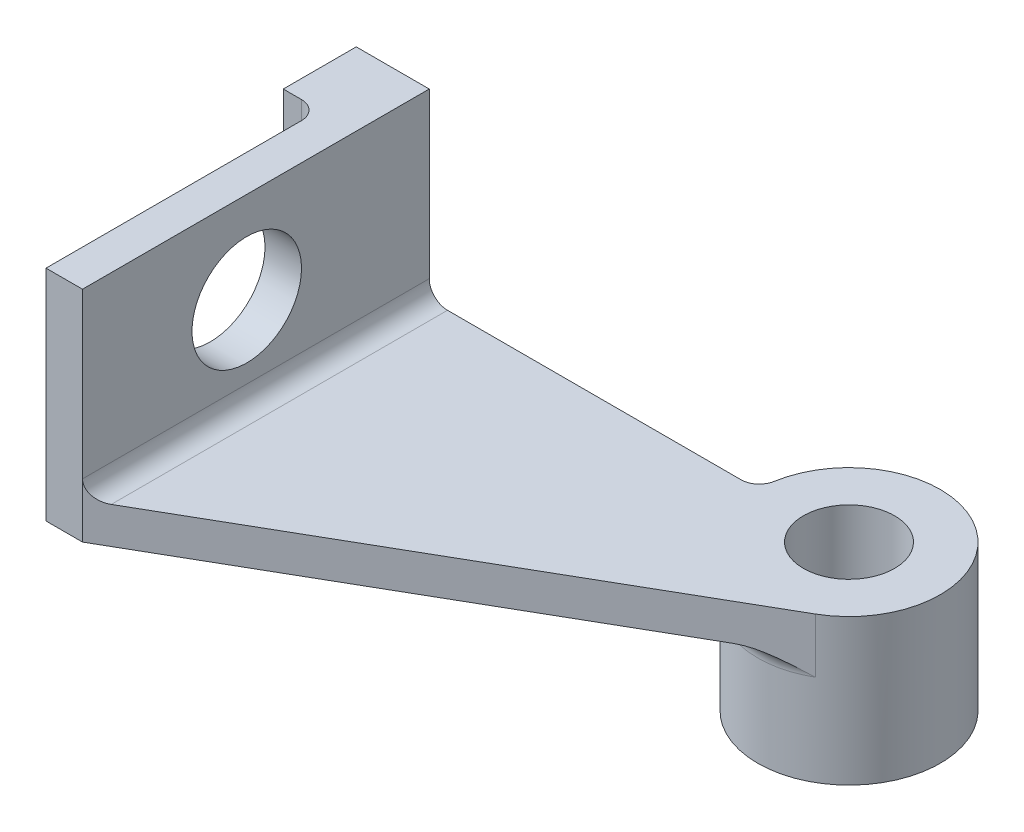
ISO-10303-21;
HEADER;
FILE_DESCRIPTION(('STEP AP214'),'2;1');
FILE_NAME('part.step','',(''),(''),'','','');
FILE_SCHEMA(('AUTOMOTIVE_DESIGN { 1 0 10303 214 1 1 1 1 }'));
ENDSEC;
DATA;
#1=APPLICATION_CONTEXT('core data for automotive mechanical design processes');
#2=APPLICATION_PROTOCOL_DEFINITION('international standard','automotive_design',2000,#1);
#3=PRODUCT_CONTEXT('',#1,'mechanical');
#4=PRODUCT('Part','Part','',(#3));
#5=PRODUCT_RELATED_PRODUCT_CATEGORY('part','',(#4));
#6=PRODUCT_DEFINITION_FORMATION('','',#4);
#7=PRODUCT_DEFINITION_CONTEXT('part definition',#1,'design');
#8=PRODUCT_DEFINITION('design','',#6,#7);
#9=PRODUCT_DEFINITION_SHAPE('','',#8);
#10=(LENGTH_UNIT() NAMED_UNIT(*) SI_UNIT(.MILLI.,.METRE.));
#11=(NAMED_UNIT(*) PLANE_ANGLE_UNIT() SI_UNIT($,.RADIAN.));
#12=(NAMED_UNIT(*) SI_UNIT($,.STERADIAN.) SOLID_ANGLE_UNIT());
#13=UNCERTAINTY_MEASURE_WITH_UNIT(LENGTH_MEASURE(1.E-05),#10,'distance_accuracy_value','');
#14=(GEOMETRIC_REPRESENTATION_CONTEXT(3) GLOBAL_UNCERTAINTY_ASSIGNED_CONTEXT((#13)) GLOBAL_UNIT_ASSIGNED_CONTEXT((#10,
#11,#12)) REPRESENTATION_CONTEXT('',''));
#15=CARTESIAN_POINT('',(0.,0.,0.));
#16=DIRECTION('',(0.,0.,1.));
#17=DIRECTION('',(1.,0.,0.));
#18=AXIS2_PLACEMENT_3D('',#15,#16,#17);
#19=CARTESIAN_POINT('',(-115.,50.,95.));
#20=DIRECTION('',(-1.,0.,0.));
#21=DIRECTION('',(0.,0.,1.));
#22=AXIS2_PLACEMENT_3D('',#19,#20,#21);
#23=PLANE('',#22);
#24=CARTESIAN_POINT('',(-115.,25.,50.));
#25=DIRECTION('',(1.,0.,0.));
#26=DIRECTION('',(0.,0.,-1.));
#27=AXIS2_PLACEMENT_3D('',#24,#25,#26);
#28=CIRCLE('',#27,15.);
#29=CARTESIAN_POINT('',(-115.,25.,35.));
#30=VERTEX_POINT('',#29);
#31=EDGE_CURVE('E163',#30,#30,#28,.T.);
#32=ORIENTED_EDGE('',*,*,#31,.F.);
#33=EDGE_LOOP('',(#32));
#34=FACE_BOUND('',#33,.T.);
#35=DIRECTION('',(0.,-1.,0.));
#36=VECTOR('',#35,1.);
#37=CARTESIAN_POINT('',(-115.,50.,95.));
#38=LINE('',#37,#36);
#39=CARTESIAN_POINT('',(-115.,50.,95.));
#40=VERTEX_POINT('',#39);
#41=CARTESIAN_POINT('',(-115.,5.00000000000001,95.));
#42=VERTEX_POINT('',#41);
#43=EDGE_CURVE('E209',#40,#42,#38,.T.);
#44=ORIENTED_EDGE('',*,*,#43,.T.);
#45=DIRECTION('',(0.,0.,1.));
#46=VECTOR('',#45,1.);
#47=CARTESIAN_POINT('',(-115.,5.,95.));
#48=LINE('',#47,#46);
#49=CARTESIAN_POINT('',(-115.,5.00000000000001,0.));
#50=VERTEX_POINT('',#49);
#51=EDGE_CURVE('E220',#42,#50,#48,.F.);
#52=ORIENTED_EDGE('',*,*,#51,.T.);
#53=DIRECTION('',(0.,-1.,0.));
#54=VECTOR('',#53,1.);
#55=CARTESIAN_POINT('',(-115.,50.,0.));
#56=LINE('',#55,#54);
#57=CARTESIAN_POINT('',(-115.,50.,0.));
#58=VERTEX_POINT('',#57);
#59=EDGE_CURVE('E206',#58,#50,#56,.T.);
#60=ORIENTED_EDGE('',*,*,#59,.F.);
#61=DIRECTION('',(0.,0.,-1.));
#62=VECTOR('',#61,1.);
#63=CARTESIAN_POINT('',(-115.,50.,95.));
#64=LINE('',#63,#62);
#65=EDGE_CURVE('E175',#40,#58,#64,.T.);
#66=ORIENTED_EDGE('',*,*,#65,.F.);
#67=EDGE_LOOP('',(#44,#52,#60,#66));
#68=FACE_BOUND('',#67,.T.);
#69=ADVANCED_FACE('F34',(#34,#68),#23,.F.);
#70=CARTESIAN_POINT('',(-125.,50.,95.));
#71=DIRECTION('',(0.,0.,-1.));
#72=DIRECTION('',(-1.,0.,0.));
#73=AXIS2_PLACEMENT_3D('',#70,#71,#72);
#74=PLANE('',#73);
#75=DIRECTION('',(1.,0.,0.));
#76=VECTOR('',#75,1.);
#77=CARTESIAN_POINT('',(-125.,-10.,95.));
#78=LINE('',#77,#76);
#79=CARTESIAN_POINT('',(-125.,-10.,95.));
#80=VERTEX_POINT('',#79);
#81=CARTESIAN_POINT('',(-115.,-10.,95.));
#82=VERTEX_POINT('',#81);
#83=EDGE_CURVE('E188',#80,#82,#78,.T.);
#84=ORIENTED_EDGE('',*,*,#83,.T.);
#85=DIRECTION('',(0.,1.,0.));
#86=VECTOR('',#85,1.);
#87=CARTESIAN_POINT('',(-115.,-10.,95.));
#88=LINE('',#87,#86);
#89=EDGE_CURVE('E56',#82,#42,#88,.T.);
#90=ORIENTED_EDGE('',*,*,#89,.T.);
#91=ORIENTED_EDGE('',*,*,#43,.F.);
#92=DIRECTION('',(1.,0.,0.));
#93=VECTOR('',#92,1.);
#94=CARTESIAN_POINT('',(-125.,50.,95.));
#95=LINE('',#94,#93);
#96=CARTESIAN_POINT('',(-125.,50.,95.));
#97=VERTEX_POINT('',#96);
#98=EDGE_CURVE('E172',#97,#40,#95,.T.);
#99=ORIENTED_EDGE('',*,*,#98,.F.);
#100=DIRECTION('',(0.,-1.,0.));
#101=VECTOR('',#100,1.);
#102=CARTESIAN_POINT('',(-125.,50.,95.));
#103=LINE('',#102,#101);
#104=EDGE_CURVE('E187',#97,#80,#103,.T.);
#105=ORIENTED_EDGE('',*,*,#104,.T.);
#106=EDGE_LOOP('',(#84,#90,#91,#99,#105));
#107=FACE_BOUND('',#106,.T.);
#108=ADVANCED_FACE('F274',(#107),#74,.F.);
#109=CARTESIAN_POINT('',(-115.,50.,0.));
#110=DIRECTION('',(0.,0.,1.));
#111=DIRECTION('',(1.,0.,0.));
#112=AXIS2_PLACEMENT_3D('',#109,#110,#111);
#113=PLANE('',#112);
#114=DIRECTION('',(-1.,0.,0.));
#115=VECTOR('',#114,1.);
#116=CARTESIAN_POINT('',(-115.,0.,0.));
#117=LINE('',#116,#115);
#118=CARTESIAN_POINT('',(-29.5803989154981,0.,0.));
#119=VERTEX_POINT('',#118);
#120=CARTESIAN_POINT('',(-110.,0.,0.));
#121=VERTEX_POINT('',#120);
#122=EDGE_CURVE('E146',#119,#121,#117,.T.);
#123=ORIENTED_EDGE('',*,*,#122,.F.);
#124=DIRECTION('',(0.,1.,0.));
#125=VECTOR('',#124,1.);
#126=CARTESIAN_POINT('',(-29.5803989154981,50.,0.));
#127=LINE('',#126,#125);
#128=CARTESIAN_POINT('',(-29.5803989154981,-10.0176376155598,0.));
#129=VERTEX_POINT('',#128);
#130=EDGE_CURVE('E64',#119,#129,#127,.F.);
#131=ORIENTED_EDGE('',*,*,#130,.T.);
#132=CARTESIAN_POINT('',(-30.,-15.,0.));
#133=DIRECTION('',(0.,0.,1.));
#134=DIRECTION('',(1.,0.,0.));
#135=AXIS2_PLACEMENT_3D('',#132,#133,#134);
#136=CIRCLE('',#135,5.);
#137=CARTESIAN_POINT('',(-30.,-10.,0.));
#138=VERTEX_POINT('',#137);
#139=EDGE_CURVE('E229',#129,#138,#136,.T.);
#140=ORIENTED_EDGE('',*,*,#139,.T.);
#141=DIRECTION('',(-1.,0.,0.));
#142=VECTOR('',#141,1.);
#143=CARTESIAN_POINT('',(-115.,-10.,0.));
#144=LINE('',#143,#142);
#145=CARTESIAN_POINT('',(-135.,-10.,0.));
#146=VERTEX_POINT('',#145);
#147=EDGE_CURVE('E190',#138,#146,#144,.T.);
#148=ORIENTED_EDGE('',*,*,#147,.T.);
#149=DIRECTION('',(0.,-1.,0.));
#150=VECTOR('',#149,1.);
#151=CARTESIAN_POINT('',(-135.,50.,0.));
#152=LINE('',#151,#150);
#153=CARTESIAN_POINT('',(-135.,50.,0.));
#154=VERTEX_POINT('',#153);
#155=EDGE_CURVE('E203',#154,#146,#152,.T.);
#156=ORIENTED_EDGE('',*,*,#155,.F.);
#157=DIRECTION('',(-1.,0.,0.));
#158=VECTOR('',#157,1.);
#159=CARTESIAN_POINT('',(-115.,50.,0.));
#160=LINE('',#159,#158);
#161=EDGE_CURVE('E178',#58,#154,#160,.T.);
#162=ORIENTED_EDGE('',*,*,#161,.F.);
#163=ORIENTED_EDGE('',*,*,#59,.T.);
#164=CARTESIAN_POINT('',(-110.,5.,0.));
#165=DIRECTION('',(0.,0.,1.));
#166=DIRECTION('',(1.,0.,0.));
#167=AXIS2_PLACEMENT_3D('',#164,#165,#166);
#168=CIRCLE('',#167,5.);
#169=EDGE_CURVE('E452',#50,#121,#168,.T.);
#170=ORIENTED_EDGE('',*,*,#169,.T.);
#171=EDGE_LOOP('',(#123,#131,#140,#148,#156,#162,#163,#170));
#172=FACE_BOUND('',#171,.T.);
#173=ADVANCED_FACE('F270',(#172),#113,.F.);
#174=CARTESIAN_POINT('',(-135.,50.,0.));
#175=DIRECTION('',(1.,0.,0.));
#176=DIRECTION('',(0.,0.,-1.));
#177=AXIS2_PLACEMENT_3D('',#174,#175,#176);
#178=PLANE('',#177);
#179=DIRECTION('',(0.,0.,1.));
#180=VECTOR('',#179,1.);
#181=CARTESIAN_POINT('',(-135.,-10.,0.));
#182=LINE('',#181,#180);
#183=CARTESIAN_POINT('',(-135.,-10.,20.));
#184=VERTEX_POINT('',#183);
#185=EDGE_CURVE('E192',#146,#184,#182,.T.);
#186=ORIENTED_EDGE('',*,*,#185,.T.);
#187=DIRECTION('',(0.,-1.,0.));
#188=VECTOR('',#187,1.);
#189=CARTESIAN_POINT('',(-135.,50.,20.));
#190=LINE('',#189,#188);
#191=CARTESIAN_POINT('',(-135.,50.,20.));
#192=VERTEX_POINT('',#191);
#193=EDGE_CURVE('E200',#192,#184,#190,.T.);
#194=ORIENTED_EDGE('',*,*,#193,.F.);
#195=DIRECTION('',(0.,0.,1.));
#196=VECTOR('',#195,1.);
#197=CARTESIAN_POINT('',(-135.,50.,0.));
#198=LINE('',#197,#196);
#199=EDGE_CURVE('E180',#154,#192,#198,.T.);
#200=ORIENTED_EDGE('',*,*,#199,.F.);
#201=ORIENTED_EDGE('',*,*,#155,.T.);
#202=EDGE_LOOP('',(#186,#194,#200,#201));
#203=FACE_BOUND('',#202,.T.);
#204=ADVANCED_FACE('F266',(#203),#178,.F.);
#205=CARTESIAN_POINT('',(-135.,50.,20.));
#206=DIRECTION('',(0.,0.,-1.));
#207=DIRECTION('',(-1.,0.,0.));
#208=AXIS2_PLACEMENT_3D('',#205,#206,#207);
#209=PLANE('',#208);
#210=DIRECTION('',(1.,0.,0.));
#211=VECTOR('',#210,1.);
#212=CARTESIAN_POINT('',(-135.,-10.,20.));
#213=LINE('',#212,#211);
#214=CARTESIAN_POINT('',(-130.,-10.,20.));
#215=VERTEX_POINT('',#214);
#216=EDGE_CURVE('E194',#184,#215,#213,.T.);
#217=ORIENTED_EDGE('',*,*,#216,.T.);
#218=DIRECTION('',(0.,-1.,0.));
#219=VECTOR('',#218,1.);
#220=CARTESIAN_POINT('',(-130.,50.,20.));
#221=LINE('',#220,#219);
#222=CARTESIAN_POINT('',(-130.,50.,20.));
#223=VERTEX_POINT('',#222);
#224=EDGE_CURVE('E225',#215,#223,#221,.F.);
#225=ORIENTED_EDGE('',*,*,#224,.T.);
#226=DIRECTION('',(1.,0.,0.));
#227=VECTOR('',#226,1.);
#228=CARTESIAN_POINT('',(-135.,50.,20.));
#229=LINE('',#228,#227);
#230=EDGE_CURVE('E182',#192,#223,#229,.T.);
#231=ORIENTED_EDGE('',*,*,#230,.F.);
#232=ORIENTED_EDGE('',*,*,#193,.T.);
#233=EDGE_LOOP('',(#217,#225,#231,#232));
#234=FACE_BOUND('',#233,.T.);
#235=ADVANCED_FACE('F262',(#234),#209,.F.);
#236=CARTESIAN_POINT('',(-125.,50.,20.));
#237=DIRECTION('',(1.,0.,0.));
#238=DIRECTION('',(0.,0.,-1.));
#239=AXIS2_PLACEMENT_3D('',#236,#237,#238);
#240=PLANE('',#239);
#241=CARTESIAN_POINT('',(-125.,25.,50.));
#242=DIRECTION('',(1.,0.,0.));
#243=DIRECTION('',(0.,0.,-1.));
#244=AXIS2_PLACEMENT_3D('',#241,#242,#243);
#245=CIRCLE('',#244,15.);
#246=CARTESIAN_POINT('',(-125.,25.,35.));
#247=VERTEX_POINT('',#246);
#248=EDGE_CURVE('E166',#247,#247,#245,.T.);
#249=ORIENTED_EDGE('',*,*,#248,.T.);
#250=EDGE_LOOP('',(#249));
#251=FACE_BOUND('',#250,.T.);
#252=DIRECTION('',(0.,0.,1.));
#253=VECTOR('',#252,1.);
#254=CARTESIAN_POINT('',(-125.,50.,20.));
#255=LINE('',#254,#253);
#256=CARTESIAN_POINT('',(-125.,50.,25.));
#257=VERTEX_POINT('',#256);
#258=EDGE_CURVE('E185',#257,#97,#255,.T.);
#259=ORIENTED_EDGE('',*,*,#258,.F.);
#260=DIRECTION('',(0.,-1.,0.));
#261=VECTOR('',#260,1.);
#262=CARTESIAN_POINT('',(-125.,-10.,25.));
#263=LINE('',#262,#261);
#264=CARTESIAN_POINT('',(-125.,-10.,25.));
#265=VERTEX_POINT('',#264);
#266=EDGE_CURVE('E222',#257,#265,#263,.T.);
#267=ORIENTED_EDGE('',*,*,#266,.T.);
#268=DIRECTION('',(0.,0.,1.));
#269=VECTOR('',#268,1.);
#270=CARTESIAN_POINT('',(-125.,-10.,20.));
#271=LINE('',#270,#269);
#272=EDGE_CURVE('E176',#265,#80,#271,.T.);
#273=ORIENTED_EDGE('',*,*,#272,.T.);
#274=ORIENTED_EDGE('',*,*,#104,.F.);
#275=EDGE_LOOP('',(#259,#267,#273,#274));
#276=FACE_BOUND('',#275,.T.);
#277=ADVANCED_FACE('F255',(#251,#276),#240,.F.);
#278=CARTESIAN_POINT('',(0.,50.,0.));
#279=DIRECTION('',(0.,1.,0.));
#280=DIRECTION('',(0.,0.,1.));
#281=AXIS2_PLACEMENT_3D('',#278,#279,#280);
#282=PLANE('',#281);
#283=ORIENTED_EDGE('',*,*,#98,.T.);
#284=ORIENTED_EDGE('',*,*,#65,.T.);
#285=ORIENTED_EDGE('',*,*,#161,.T.);
#286=ORIENTED_EDGE('',*,*,#199,.T.);
#287=ORIENTED_EDGE('',*,*,#230,.T.);
#288=CARTESIAN_POINT('',(-130.,50.,25.));
#289=DIRECTION('',(0.,1.,0.));
#290=DIRECTION('',(0.,0.,1.));
#291=AXIS2_PLACEMENT_3D('',#288,#289,#290);
#292=CIRCLE('',#291,5.);
#293=EDGE_CURVE('E11',#223,#257,#292,.F.);
#294=ORIENTED_EDGE('',*,*,#293,.T.);
#295=ORIENTED_EDGE('',*,*,#258,.T.);
#296=EDGE_LOOP('',(#283,#284,#285,#286,#287,#294,#295));
#297=FACE_BOUND('',#296,.T.);
#298=ADVANCED_FACE('F252',(#297),#282,.T.);
#299=CARTESIAN_POINT('',(0.,-10.,0.));
#300=DIRECTION('',(0.,1.,0.));
#301=DIRECTION('',(0.,0.,1.));
#302=AXIS2_PLACEMENT_3D('',#299,#300,#301);
#303=PLANE('',#302);
#304=ORIENTED_EDGE('',*,*,#147,.F.);
#305=CARTESIAN_POINT('',(0.,-10.,0.));
#306=DIRECTION('',(0.,1.,0.));
#307=DIRECTION('',(0.,0.,1.));
#308=AXIS2_PLACEMENT_3D('',#305,#306,#307);
#309=CIRCLE('',#308,30.);
#310=CARTESIAN_POINT('',(-1.90773790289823,-10.,29.939280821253));
#311=VERTEX_POINT('',#310);
#312=EDGE_CURVE('E217',#138,#311,#309,.T.);
#313=ORIENTED_EDGE('',*,*,#312,.T.);
#314=DIRECTION('',(0.866798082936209,0.,-0.498659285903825));
#315=VECTOR('',#314,1.);
#316=CARTESIAN_POINT('',(-115.,-10.,95.));
#317=LINE('',#316,#315);
#318=EDGE_CURVE('E168',#82,#311,#317,.T.);
#319=ORIENTED_EDGE('',*,*,#318,.F.);
#320=ORIENTED_EDGE('',*,*,#83,.F.);
#321=ORIENTED_EDGE('',*,*,#272,.F.);
#322=CARTESIAN_POINT('',(-130.,-10.,25.));
#323=DIRECTION('',(0.,1.,0.));
#324=DIRECTION('',(0.,0.,1.));
#325=AXIS2_PLACEMENT_3D('',#322,#323,#324);
#326=CIRCLE('',#325,5.);
#327=EDGE_CURVE('E49',#265,#215,#326,.T.);
#328=ORIENTED_EDGE('',*,*,#327,.T.);
#329=ORIENTED_EDGE('',*,*,#216,.F.);
#330=ORIENTED_EDGE('',*,*,#185,.F.);
#331=EDGE_LOOP('',(#304,#313,#319,#320,#321,#328,#329,#330));
#332=FACE_BOUND('',#331,.T.);
#333=ADVANCED_FACE('F250',(#332),#303,.F.);
#334=CARTESIAN_POINT('',(-135.,25.,50.));
#335=DIRECTION('',(1.,0.,0.));
#336=DIRECTION('',(0.,0.,-1.));
#337=AXIS2_PLACEMENT_3D('',#334,#335,#336);
#338=CYLINDRICAL_SURFACE('',#337,15.);
#339=ORIENTED_EDGE('',*,*,#31,.T.);
#340=EDGE_LOOP('',(#339));
#341=FACE_BOUND('',#340,.T.);
#342=ORIENTED_EDGE('',*,*,#248,.F.);
#343=EDGE_LOOP('',(#342));
#344=FACE_BOUND('',#343,.T.);
#345=ADVANCED_FACE('F246',(#341,#344),#338,.F.);
#346=CARTESIAN_POINT('',(-115.,-10.,95.));
#347=DIRECTION('',(0.498659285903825,0.,0.866798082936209));
#348=DIRECTION('',(0.866798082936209,0.,-0.498659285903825));
#349=AXIS2_PLACEMENT_3D('',#346,#347,#348);
#350=PLANE('',#349);
#351=DIRECTION('',(0.866798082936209,0.,-0.498659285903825));
#352=VECTOR('',#351,1.);
#353=CARTESIAN_POINT('',(-115.,0.,95.));
#354=LINE('',#353,#352);
#355=CARTESIAN_POINT('',(-110.,0.,92.1235556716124));
#356=VERTEX_POINT('',#355);
#357=CARTESIAN_POINT('',(12.4664821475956,0.,21.6699520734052));
#358=VERTEX_POINT('',#357);
#359=EDGE_CURVE('E135',#356,#358,#354,.T.);
#360=ORIENTED_EDGE('',*,*,#359,.F.);
#361=CARTESIAN_POINT('',(-110.,5.,92.1235556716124));
#362=DIRECTION('',(0.498659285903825,0.,0.866798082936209));
#363=DIRECTION('',(-0.866798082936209,0.,0.498659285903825));
#364=AXIS2_PLACEMENT_3D('',#361,#362,#363);
#365=ELLIPSE('',#364,5.76835608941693,5.);
#366=EDGE_CURVE('E237',#356,#42,#365,.F.);
#367=ORIENTED_EDGE('',*,*,#366,.T.);
#368=ORIENTED_EDGE('',*,*,#89,.F.);
#369=ORIENTED_EDGE('',*,*,#318,.T.);
#370=CARTESIAN_POINT('',(-1.90773790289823,-10.,29.939280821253));
#371=CARTESIAN_POINT('',(-1.64043073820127,-10.0000404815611,29.785501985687));
#372=CARTESIAN_POINT('',(-1.37320869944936,-10.0087151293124,29.6317721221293));
#373=CARTESIAN_POINT('',(-0.839628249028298,-10.0416022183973,29.3248092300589));
#374=CARTESIAN_POINT('',(-0.573269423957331,-10.0658055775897,29.1715759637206));
#375=CARTESIAN_POINT('',(-0.0425508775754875,-10.1279351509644,28.8662594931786));
#376=CARTESIAN_POINT('',(0.221812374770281,-10.1658221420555,28.7141742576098));
#377=CARTESIAN_POINT('',(0.749020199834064,-10.2538837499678,28.4108774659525));
#378=CARTESIAN_POINT('',(1.01186452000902,-10.3040603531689,28.2596660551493));
#379=CARTESIAN_POINT('',(1.79189708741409,-10.4697787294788,27.8109220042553));
#380=CARTESIAN_POINT('',(2.30656017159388,-10.6012712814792,27.5148420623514));
#381=CARTESIAN_POINT('',(3.32867019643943,-10.8984960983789,26.9268335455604));
#382=CARTESIAN_POINT('',(3.83611074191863,-11.0642569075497,26.6349086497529));
#383=CARTESIAN_POINT('',(4.6871139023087,-11.3670978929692,26.1453360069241));
#384=CARTESIAN_POINT('',(5.03260074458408,-11.4970840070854,25.946581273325));
#385=CARTESIAN_POINT('',(5.72038175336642,-11.7678849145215,25.550908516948));
#386=CARTESIAN_POINT('',(6.06267574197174,-11.9087003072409,25.3539905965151));
#387=CARTESIAN_POINT('',(7.0851302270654,-12.3445325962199,24.7657839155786));
#388=CARTESIAN_POINT('',(7.76098114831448,-12.652978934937,24.3769744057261));
#389=CARTESIAN_POINT('',(9.7801214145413,-13.6139959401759,23.2153854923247));
#390=CARTESIAN_POINT('',(11.1109445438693,-14.3006273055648,22.4497777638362));
#391=CARTESIAN_POINT('',(12.4498006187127,-14.9913933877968,21.6795487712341));
#392=CARTESIAN_POINT('',(12.4581413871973,-14.9956967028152,21.6747504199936));
#393=CARTESIAN_POINT('',(12.4664821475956,-15.,21.6699520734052));
#394=B_SPLINE_CURVE_WITH_KNOTS('',3,(#370,#371,#372,#373,#374,#375,#376,#377,#378,#379,#380,
#381,#382,#383,#384,#385,#386,#387,#388,#389,#390,#391,#392,#393),.UNSPECIFIED.,.F.,.F.,(4,2,2,
2,2,2,2,2,2,2,2,4),(0.,0.924891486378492,1.84924253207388,2.77096475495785,3.69283605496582,
5.51582575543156,7.34034010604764,8.59789194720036,9.855513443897,12.3703286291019,
17.4147711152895,17.4463938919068),.UNSPECIFIED.);
#395=CARTESIAN_POINT('',(12.4664821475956,-15.,21.6699520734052));
#396=VERTEX_POINT('',#395);
#397=EDGE_CURVE('E161',#311,#396,#394,.T.);
#398=ORIENTED_EDGE('',*,*,#397,.T.);
#399=DIRECTION('',(0.,1.,0.));
#400=VECTOR('',#399,1.);
#401=CARTESIAN_POINT('',(12.4664821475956,-10.,21.6699520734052));
#402=LINE('',#401,#400);
#403=EDGE_CURVE('E152',#396,#358,#402,.T.);
#404=ORIENTED_EDGE('',*,*,#403,.T.);
#405=EDGE_LOOP('',(#360,#367,#368,#369,#398,#404));
#406=FACE_BOUND('',#405,.T.);
#407=ADVANCED_FACE('F158',(#406),#350,.T.);
#408=CARTESIAN_POINT('',(0.,0.,0.));
#409=DIRECTION('',(0.,1.,0.));
#410=DIRECTION('',(0.,0.,1.));
#411=AXIS2_PLACEMENT_3D('',#408,#409,#410);
#412=PLANE('',#411);
#413=ORIENTED_EDGE('',*,*,#122,.T.);
#414=DIRECTION('',(0.,0.,1.));
#415=VECTOR('',#414,1.);
#416=CARTESIAN_POINT('',(-110.,0.,0.));
#417=LINE('',#416,#415);
#418=EDGE_CURVE('E142',#121,#356,#417,.T.);
#419=ORIENTED_EDGE('',*,*,#418,.T.);
#420=ORIENTED_EDGE('',*,*,#359,.T.);
#421=CARTESIAN_POINT('',(0.,0.,0.));
#422=DIRECTION('',(0.,1.,0.));
#423=DIRECTION('',(0.,0.,1.));
#424=AXIS2_PLACEMENT_3D('',#421,#422,#423);
#425=CIRCLE('',#424,25.);
#426=CARTESIAN_POINT('',(-24.6503324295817,0.,-4.16666666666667));
#427=VERTEX_POINT('',#426);
#428=EDGE_CURVE('E140',#358,#427,#425,.T.);
#429=ORIENTED_EDGE('',*,*,#428,.T.);
#430=CARTESIAN_POINT('',(-29.5803989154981,0.,-5.00000000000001));
#431=DIRECTION('',(0.,1.,0.));
#432=DIRECTION('',(0.,0.,1.));
#433=AXIS2_PLACEMENT_3D('',#430,#431,#432);
#434=CIRCLE('',#433,5.);
#435=EDGE_CURVE('E227',#427,#119,#434,.F.);
#436=ORIENTED_EDGE('',*,*,#435,.T.);
#437=EDGE_LOOP('',(#413,#419,#420,#429,#436));
#438=FACE_BOUND('',#437,.T.);
#439=CARTESIAN_POINT('',(0.,0.,0.));
#440=DIRECTION('',(0.,1.,0.));
#441=DIRECTION('',(0.,0.,1.));
#442=AXIS2_PLACEMENT_3D('',#439,#440,#441);
#443=CIRCLE('',#442,12.5);
#444=CARTESIAN_POINT('',(0.,0.,12.5));
#445=VERTEX_POINT('',#444);
#446=EDGE_CURVE('E292',#445,#445,#443,.T.);
#447=ORIENTED_EDGE('',*,*,#446,.F.);
#448=EDGE_LOOP('',(#447));
#449=FACE_BOUND('',#448,.T.);
#450=ADVANCED_FACE('F138',(#438,#449),#412,.T.);
#451=CARTESIAN_POINT('',(0.,-40.,0.));
#452=DIRECTION('',(0.,1.,0.));
#453=DIRECTION('',(0.,0.,1.));
#454=AXIS2_PLACEMENT_3D('',#451,#452,#453);
#455=CYLINDRICAL_SURFACE('',#454,25.);
#456=CARTESIAN_POINT('',(0.,-40.,0.));
#457=DIRECTION('',(0.,1.,0.));
#458=DIRECTION('',(0.,0.,1.));
#459=AXIS2_PLACEMENT_3D('',#456,#457,#458);
#460=CIRCLE('',#459,25.);
#461=CARTESIAN_POINT('',(0.,-40.,25.));
#462=VERTEX_POINT('',#461);
#463=EDGE_CURVE('E147',#462,#462,#460,.T.);
#464=ORIENTED_EDGE('',*,*,#463,.T.);
#465=EDGE_LOOP('',(#464));
#466=FACE_BOUND('',#465,.T.);
#467=CARTESIAN_POINT('',(0.,-15.,0.));
#468=DIRECTION('',(0.,1.,0.));
#469=DIRECTION('',(0.,0.,1.));
#470=AXIS2_PLACEMENT_3D('',#467,#468,#469);
#471=CIRCLE('',#470,25.);
#472=CARTESIAN_POINT('',(-24.6503324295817,-15.,-4.16666666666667));
#473=VERTEX_POINT('',#472);
#474=EDGE_CURVE('E211',#396,#473,#471,.F.);
#475=ORIENTED_EDGE('',*,*,#474,.T.);
#476=DIRECTION('',(0.,1.,0.));
#477=VECTOR('',#476,1.);
#478=CARTESIAN_POINT('',(-24.6503324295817,-40.,-4.16666666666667));
#479=LINE('',#478,#477);
#480=EDGE_CURVE('E155',#473,#427,#479,.T.);
#481=ORIENTED_EDGE('',*,*,#480,.T.);
#482=ORIENTED_EDGE('',*,*,#428,.F.);
#483=ORIENTED_EDGE('',*,*,#403,.F.);
#484=EDGE_LOOP('',(#475,#481,#482,#483));
#485=FACE_BOUND('',#484,.T.);
#486=ADVANCED_FACE('F151',(#466,#485),#455,.T.);
#487=CARTESIAN_POINT('',(0.,-40.,0.));
#488=DIRECTION('',(0.,1.,0.));
#489=DIRECTION('',(0.,0.,1.));
#490=AXIS2_PLACEMENT_3D('',#487,#488,#489);
#491=PLANE('',#490);
#492=CARTESIAN_POINT('',(0.,-40.,0.));
#493=DIRECTION('',(0.,1.,0.));
#494=DIRECTION('',(0.,0.,1.));
#495=AXIS2_PLACEMENT_3D('',#492,#493,#494);
#496=CIRCLE('',#495,12.5);
#497=CARTESIAN_POINT('',(0.,-40.,12.5));
#498=VERTEX_POINT('',#497);
#499=EDGE_CURVE('E156',#498,#498,#496,.T.);
#500=ORIENTED_EDGE('',*,*,#499,.T.);
#501=EDGE_LOOP('',(#500));
#502=FACE_BOUND('',#501,.T.);
#503=ORIENTED_EDGE('',*,*,#463,.F.);
#504=EDGE_LOOP('',(#503));
#505=FACE_BOUND('',#504,.T.);
#506=ADVANCED_FACE('F298',(#502,#505),#491,.F.);
#507=CARTESIAN_POINT('',(0.,-40.,0.));
#508=DIRECTION('',(0.,1.,0.));
#509=DIRECTION('',(0.,0.,1.));
#510=AXIS2_PLACEMENT_3D('',#507,#508,#509);
#511=CYLINDRICAL_SURFACE('',#510,12.5);
#512=ORIENTED_EDGE('',*,*,#499,.F.);
#513=EDGE_LOOP('',(#512));
#514=FACE_BOUND('',#513,.T.);
#515=ORIENTED_EDGE('',*,*,#446,.T.);
#516=EDGE_LOOP('',(#515));
#517=FACE_BOUND('',#516,.T.);
#518=ADVANCED_FACE('F301',(#514,#517),#511,.F.);
#519=CARTESIAN_POINT('',(0.,-15.,0.));
#520=DIRECTION('',(0.,1.,0.));
#521=DIRECTION('',(0.,0.,1.));
#522=AXIS2_PLACEMENT_3D('',#519,#520,#521);
#523=TOROIDAL_SURFACE('',#522,30.,5.);
#524=ORIENTED_EDGE('',*,*,#312,.F.);
#525=ORIENTED_EDGE('',*,*,#139,.F.);
#526=CARTESIAN_POINT('',(-29.5803989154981,-10.0176376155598,0.));
#527=CARTESIAN_POINT('',(-29.4649122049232,-10.0273312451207,3.00488329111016E-05));
#528=CARTESIAN_POINT('',(-29.3498006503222,-10.0410998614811,-0.00399961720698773));
#529=CARTESIAN_POINT('',(-29.1214381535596,-10.0764457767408,-0.0198032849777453));
#530=CARTESIAN_POINT('',(-29.0081854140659,-10.0980150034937,-0.0315692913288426));
#531=CARTESIAN_POINT('',(-28.7854805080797,-10.148399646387,-0.062323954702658));
#532=CARTESIAN_POINT('',(-28.6760023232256,-10.1771436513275,-0.0812423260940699));
#533=CARTESIAN_POINT('',(-28.4604744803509,-10.2415003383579,-0.125794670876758));
#534=CARTESIAN_POINT('',(-28.3544255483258,-10.2771144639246,-0.151430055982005));
#535=CARTESIAN_POINT('',(-28.1468305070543,-10.354490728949,-0.208713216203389));
#536=CARTESIAN_POINT('',(-28.0452671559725,-10.3962260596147,-0.240334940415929));
#537=CARTESIAN_POINT('',(-27.8465646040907,-10.4853787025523,-0.309063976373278));
#538=CARTESIAN_POINT('',(-27.74942717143,-10.5327982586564,-0.346173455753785));
#539=CARTESIAN_POINT('',(-27.4647760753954,-10.6828741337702,-0.464975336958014));
#540=CARTESIAN_POINT('',(-27.2843500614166,-10.7932231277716,-0.554047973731));
#541=CARTESIAN_POINT('',(-26.8565193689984,-11.0902225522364,-0.796653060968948));
#542=CARTESIAN_POINT('',(-26.6217709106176,-11.28712003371,-0.959917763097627));
#543=CARTESIAN_POINT('',(-26.3022483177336,-11.6005772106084,-1.22206467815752));
#544=CARTESIAN_POINT('',(-26.2010297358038,-11.7082803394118,-1.31249071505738));
#545=CARTESIAN_POINT('',(-26.0089853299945,-11.9286814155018,-1.49816863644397));
#546=CARTESIAN_POINT('',(-25.9181571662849,-12.0413782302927,-1.59341942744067));
#547=CARTESIAN_POINT('',(-25.705840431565,-12.3250246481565,-1.83387756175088));
#548=CARTESIAN_POINT('',(-25.5901486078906,-12.4983333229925,-1.98141980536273));
#549=CARTESIAN_POINT('',(-25.3788368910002,-12.8512933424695,-2.28323271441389));
#550=CARTESIAN_POINT('',(-25.2832285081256,-13.0309482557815,-2.4375071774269));
#551=CARTESIAN_POINT('',(-25.1110646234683,-13.3944640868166,-2.75121488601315));
#552=CARTESIAN_POINT('',(-25.0344928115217,-13.578321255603,-2.91064358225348));
#553=CARTESIAN_POINT('',(-24.8994838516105,-13.9487578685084,-3.23374088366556));
#554=CARTESIAN_POINT('',(-24.8410374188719,-14.1353358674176,-3.39740727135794));
#555=CARTESIAN_POINT('',(-24.7620037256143,-14.4334811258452,-3.6607790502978));
#556=CARTESIAN_POINT('',(-24.7356996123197,-14.5445906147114,-3.75933269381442));
#557=CARTESIAN_POINT('',(-24.6892262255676,-14.7669887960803,-3.95751235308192));
#558=CARTESIAN_POINT('',(-24.6690518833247,-14.8782772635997,-4.0571374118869));
#559=CARTESIAN_POINT('',(-24.6513948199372,-14.9930369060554,-4.16039967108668));
#560=CARTESIAN_POINT('',(-24.6508621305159,-14.9965184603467,-4.16353292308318));
#561=CARTESIAN_POINT('',(-24.6503324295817,-15.,-4.16666666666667));
#562=B_SPLINE_CURVE_WITH_KNOTS('',3,(#526,#527,#528,#529,#530,#531,#532,#533,#534,#535,#536,
#537,#538,#539,#540,#541,#542,#543,#544,#545,#546,#547,#548,#549,#550,#551,#552,#553,#554,#555,
#556,#557,#558,#559,#560,#561),.UNSPECIFIED.,.F.,.F.,(4,2,2,2,2,2,2,2,2,2,2,2,2,2,2,2,2,4),(0.,
0.347488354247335,0.694618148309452,1.03842184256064,1.38229785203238,1.72471044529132,
2.06725865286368,2.75342820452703,3.78887809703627,4.30837517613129,4.82775503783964,
5.59259680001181,6.35787572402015,7.12249669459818,7.8867253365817,8.33911275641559,
8.791125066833,8.80526720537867),.UNSPECIFIED.);
#563=EDGE_CURVE('E38',#473,#129,#562,.F.);
#564=ORIENTED_EDGE('',*,*,#563,.F.);
#565=ORIENTED_EDGE('',*,*,#474,.F.);
#566=ORIENTED_EDGE('',*,*,#397,.F.);
#567=EDGE_LOOP('',(#524,#525,#564,#565,#566));
#568=FACE_BOUND('',#567,.T.);
#569=ADVANCED_FACE('F239',(#568),#523,.F.);
#570=CARTESIAN_POINT('',(-29.5803989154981,-40.,-5.00000000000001));
#571=DIRECTION('',(0.,1.,0.));
#572=DIRECTION('',(0.,0.,1.));
#573=AXIS2_PLACEMENT_3D('',#570,#571,#572);
#574=CYLINDRICAL_SURFACE('',#573,5.);
#575=ORIENTED_EDGE('',*,*,#563,.T.);
#576=ORIENTED_EDGE('',*,*,#130,.F.);
#577=ORIENTED_EDGE('',*,*,#435,.F.);
#578=ORIENTED_EDGE('',*,*,#480,.F.);
#579=EDGE_LOOP('',(#575,#576,#577,#578));
#580=FACE_BOUND('',#579,.T.);
#581=ADVANCED_FACE('F330',(#580),#574,.F.);
#582=CARTESIAN_POINT('',(-110.,5.,0.));
#583=DIRECTION('',(0.,0.,1.));
#584=DIRECTION('',(1.,0.,0.));
#585=AXIS2_PLACEMENT_3D('',#582,#583,#584);
#586=CYLINDRICAL_SURFACE('',#585,5.);
#587=ORIENTED_EDGE('',*,*,#169,.F.);
#588=ORIENTED_EDGE('',*,*,#51,.F.);
#589=ORIENTED_EDGE('',*,*,#366,.F.);
#590=ORIENTED_EDGE('',*,*,#418,.F.);
#591=EDGE_LOOP('',(#587,#588,#589,#590));
#592=FACE_BOUND('',#591,.T.);
#593=ADVANCED_FACE('F337',(#592),#586,.F.);
#594=CARTESIAN_POINT('',(-130.,50.,25.));
#595=DIRECTION('',(0.,1.,0.));
#596=DIRECTION('',(0.,0.,1.));
#597=AXIS2_PLACEMENT_3D('',#594,#595,#596);
#598=CYLINDRICAL_SURFACE('',#597,5.);
#599=ORIENTED_EDGE('',*,*,#293,.F.);
#600=ORIENTED_EDGE('',*,*,#224,.F.);
#601=ORIENTED_EDGE('',*,*,#327,.F.);
#602=ORIENTED_EDGE('',*,*,#266,.F.);
#603=EDGE_LOOP('',(#599,#600,#601,#602));
#604=FACE_BOUND('',#603,.T.);
#605=ADVANCED_FACE('F36',(#604),#598,.F.);
#606=CLOSED_SHELL('',(#69,#108,#173,#204,#235,#277,#298,#333,#345,#407,#450,#486,#506,#518,#569,
#581,#593,#605));
#607=MANIFOLD_SOLID_BREP('B2',#606);
#608=ADVANCED_BREP_SHAPE_REPRESENTATION('',(#18,#607),#14);
#609=SHAPE_DEFINITION_REPRESENTATION(#9,#608);
ENDSEC;
END-ISO-10303-21;
